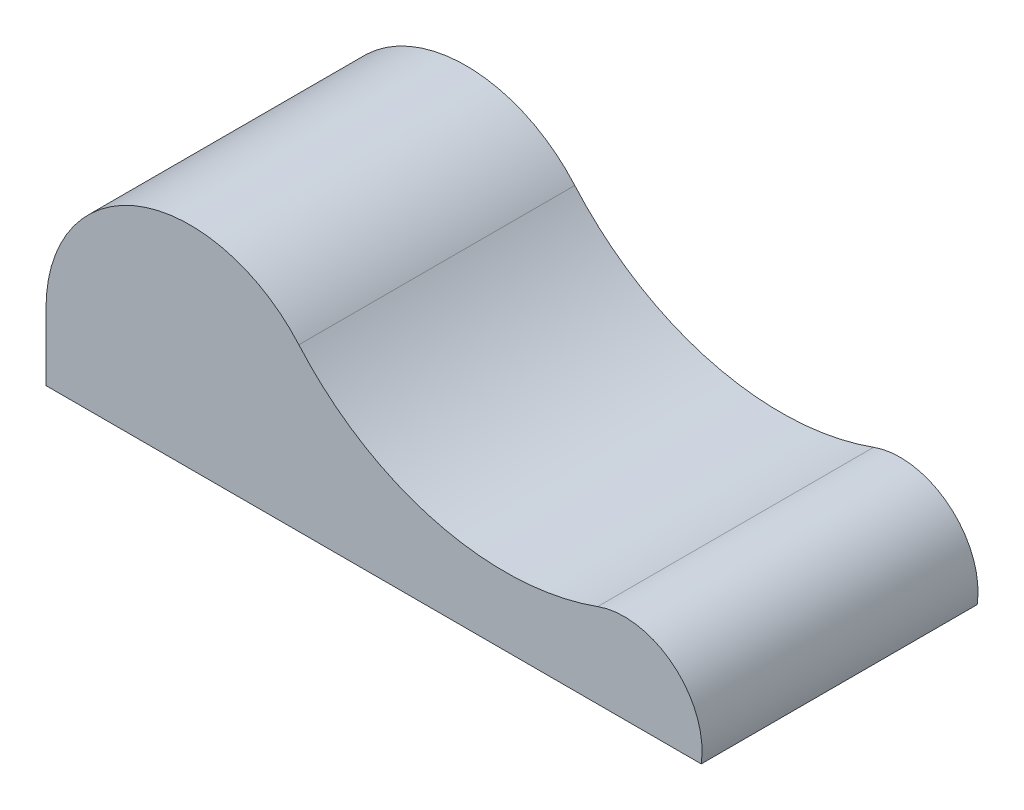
from build123d import *

# Parameters (mm, degrees)
EXTRUDE1_DEPTH = 35.5


with BuildPart() as part:
    # Sketch1 → Extrude1 (new, symmetric)
    with BuildSketch(Plane(origin=(0, 0, 0), x_dir=(-1, 0, 0), z_dir=(0, 0, -1))):
        with BuildLine():
            Line((-84.297345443, 0), (84.297345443, 0))
            Line((84.297345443, 0), (84.297345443, 17.254948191))
            ThreePointArc((84.297345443, 17.254948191), (60.217233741, 51.992881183), (19.238703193, 41.632581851))
            ThreePointArc((19.238703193, 41.632581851), (-16.12915701, 19.780945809), (-57.656533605, 21.744749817))
            ThreePointArc((-57.656533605, 21.744749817), (-77.145514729, 18.429870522), (-84.297345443, 0))
        make_face()
    extrude(amount=EXTRUDE1_DEPTH, both=True)


solid = part.part
